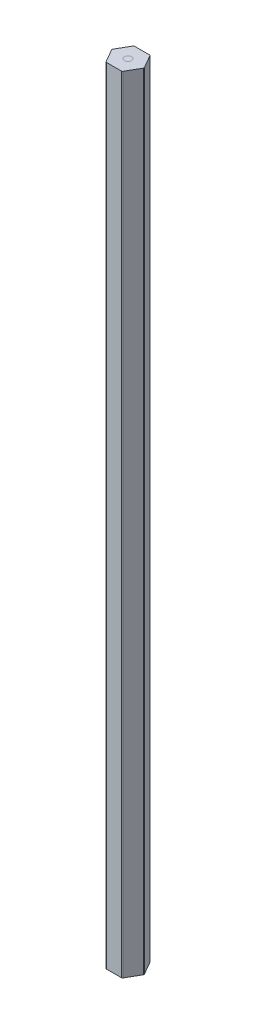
ISO-10303-21;
HEADER;
FILE_DESCRIPTION(('STEP AP214'),'2;1');
FILE_NAME('part.step','',(''),(''),'','','');
FILE_SCHEMA(('AUTOMOTIVE_DESIGN { 1 0 10303 214 1 1 1 1 }'));
ENDSEC;
DATA;
#1=APPLICATION_CONTEXT('core data for automotive mechanical design processes');
#2=APPLICATION_PROTOCOL_DEFINITION('international standard','automotive_design',2000,#1);
#3=PRODUCT_CONTEXT('',#1,'mechanical');
#4=PRODUCT('Part','Part','',(#3));
#5=PRODUCT_RELATED_PRODUCT_CATEGORY('part','',(#4));
#6=PRODUCT_DEFINITION_FORMATION('','',#4);
#7=PRODUCT_DEFINITION_CONTEXT('part definition',#1,'design');
#8=PRODUCT_DEFINITION('design','',#6,#7);
#9=PRODUCT_DEFINITION_SHAPE('','',#8);
#10=(LENGTH_UNIT() NAMED_UNIT(*) SI_UNIT(.MILLI.,.METRE.));
#11=(NAMED_UNIT(*) PLANE_ANGLE_UNIT() SI_UNIT($,.RADIAN.));
#12=(NAMED_UNIT(*) SI_UNIT($,.STERADIAN.) SOLID_ANGLE_UNIT());
#13=UNCERTAINTY_MEASURE_WITH_UNIT(LENGTH_MEASURE(1.E-05),#10,'distance_accuracy_value','');
#14=(GEOMETRIC_REPRESENTATION_CONTEXT(3) GLOBAL_UNCERTAINTY_ASSIGNED_CONTEXT((#13)) GLOBAL_UNIT_ASSIGNED_CONTEXT((#10,
#11,#12)) REPRESENTATION_CONTEXT('',''));
#15=CARTESIAN_POINT('',(0.,0.,0.));
#16=DIRECTION('',(0.,0.,1.));
#17=DIRECTION('',(1.,0.,0.));
#18=AXIS2_PLACEMENT_3D('',#15,#16,#17);
#19=CARTESIAN_POINT('',(0.,177.8,0.));
#20=DIRECTION('',(0.,-1.,0.));
#21=DIRECTION('',(0.,0.,-1.));
#22=AXIS2_PLACEMENT_3D('',#19,#20,#21);
#23=CYLINDRICAL_SURFACE('',#22,0.79375);
#24=CARTESIAN_POINT('',(0.,177.8,0.));
#25=DIRECTION('',(0.,-1.,0.));
#26=DIRECTION('',(0.,0.,-1.));
#27=AXIS2_PLACEMENT_3D('',#24,#25,#26);
#28=CIRCLE('',#27,0.79375);
#29=CARTESIAN_POINT('',(0.,177.8,-0.79375));
#30=VERTEX_POINT('',#29);
#31=EDGE_CURVE('E11',#30,#30,#28,.T.);
#32=ORIENTED_EDGE('',*,*,#31,.T.);
#33=EDGE_LOOP('',(#32));
#34=FACE_BOUND('',#33,.T.);
#35=CARTESIAN_POINT('',(0.,0.,0.));
#36=DIRECTION('',(0.,-1.,0.));
#37=DIRECTION('',(0.,0.,-1.));
#38=AXIS2_PLACEMENT_3D('',#35,#36,#37);
#39=CIRCLE('',#38,0.79375);
#40=CARTESIAN_POINT('',(0.,0.,-0.79375));
#41=VERTEX_POINT('',#40);
#42=EDGE_CURVE('E45',#41,#41,#39,.T.);
#43=ORIENTED_EDGE('',*,*,#42,.F.);
#44=EDGE_LOOP('',(#43));
#45=FACE_BOUND('',#44,.T.);
#46=ADVANCED_FACE('F42',(#34,#45),#23,.T.);
#47=CARTESIAN_POINT('',(0.,177.8,0.));
#48=DIRECTION('',(0.,-1.,0.));
#49=DIRECTION('',(0.,0.,-1.));
#50=AXIS2_PLACEMENT_3D('',#47,#48,#49);
#51=PLANE('',#50);
#52=ORIENTED_EDGE('',*,*,#31,.F.);
#53=EDGE_LOOP('',(#52));
#54=FACE_BOUND('',#53,.T.);
#55=ADVANCED_FACE('F57',(#54),#51,.F.);
#56=CARTESIAN_POINT('',(0.,0.,0.));
#57=DIRECTION('',(0.,-1.,0.));
#58=DIRECTION('',(0.,0.,-1.));
#59=AXIS2_PLACEMENT_3D('',#56,#57,#58);
#60=PLANE('',#59);
#61=ORIENTED_EDGE('',*,*,#42,.T.);
#62=EDGE_LOOP('',(#61));
#63=FACE_BOUND('',#62,.T.);
#64=ADVANCED_FACE('F54',(#63),#60,.T.);
#65=CLOSED_SHELL('',(#46,#55,#64));
#66=MANIFOLD_SOLID_BREP('B2',#65);
#67=CARTESIAN_POINT('',(-1.68644013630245,177.8,-2.92100000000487));
#68=DIRECTION('',(0.,-1.,0.));
#69=DIRECTION('',(0.,0.,-1.));
#70=AXIS2_PLACEMENT_3D('',#67,#68,#69);
#71=PLANE('',#70);
#72=CARTESIAN_POINT('',(-1.68644013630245,177.8,-2.92100000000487));
#73=DIRECTION('',(0.,1.,0.));
#74=DIRECTION('',(0.,0.,-1.));
#75=AXIS2_PLACEMENT_3D('',#72,#73,#74);
#76=CIRCLE('',#75,0.254);
#77=CARTESIAN_POINT('',(-1.68644013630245,177.8,-3.17500000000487));
#78=VERTEX_POINT('',#77);
#79=CARTESIAN_POINT('',(-1.9064105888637,177.8,-3.04800000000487));
#80=VERTEX_POINT('',#79);
#81=EDGE_CURVE('E226',#78,#80,#76,.T.);
#82=ORIENTED_EDGE('',*,*,#81,.T.);
#83=DIRECTION('',(-0.5,0.,0.866025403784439));
#84=VECTOR('',#83,1.);
#85=CARTESIAN_POINT('',(-1.9064105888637,177.8,-3.04800000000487));
#86=LINE('',#85,#84);
#87=CARTESIAN_POINT('',(-3.59285072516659,177.8,-0.127000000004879));
#88=VERTEX_POINT('',#87);
#89=EDGE_CURVE('E154',#80,#88,#86,.T.);
#90=ORIENTED_EDGE('',*,*,#89,.T.);
#91=CARTESIAN_POINT('',(-3.37288027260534,177.8,-4.87794876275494E-12));
#92=DIRECTION('',(0.,1.,0.));
#93=DIRECTION('',(0.,0.,1.));
#94=AXIS2_PLACEMENT_3D('',#91,#92,#93);
#95=CIRCLE('',#94,0.254);
#96=CARTESIAN_POINT('',(-3.59285072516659,177.8,0.126999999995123));
#97=VERTEX_POINT('',#96);
#98=EDGE_CURVE('E253',#88,#97,#95,.T.);
#99=ORIENTED_EDGE('',*,*,#98,.T.);
#100=DIRECTION('',(0.5,0.,0.866025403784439));
#101=VECTOR('',#100,1.);
#102=CARTESIAN_POINT('',(-1.90641058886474,177.8,3.04799999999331));
#103=LINE('',#102,#101);
#104=CARTESIAN_POINT('',(-1.90641058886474,177.8,3.04799999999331));
#105=VERTEX_POINT('',#104);
#106=EDGE_CURVE('E272',#97,#105,#103,.T.);
#107=ORIENTED_EDGE('',*,*,#106,.T.);
#108=CARTESIAN_POINT('',(-1.68644013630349,177.8,2.92099999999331));
#109=DIRECTION('',(0.,1.,0.));
#110=DIRECTION('',(0.,0.,1.));
#111=AXIS2_PLACEMENT_3D('',#108,#109,#110);
#112=CIRCLE('',#111,0.254);
#113=CARTESIAN_POINT('',(-1.68644013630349,177.8,3.17499999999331));
#114=VERTEX_POINT('',#113);
#115=EDGE_CURVE('E269',#105,#114,#112,.T.);
#116=ORIENTED_EDGE('',*,*,#115,.T.);
#117=DIRECTION('',(1.,0.,0.));
#118=VECTOR('',#117,1.);
#119=CARTESIAN_POINT('',(-1.68644013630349,177.8,3.17499999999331));
#120=LINE('',#119,#118);
#121=CARTESIAN_POINT('',(1.68644013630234,177.8,3.17499999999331));
#122=VERTEX_POINT('',#121);
#123=EDGE_CURVE('E271',#114,#122,#120,.T.);
#124=ORIENTED_EDGE('',*,*,#123,.T.);
#125=CARTESIAN_POINT('',(1.68644013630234,177.8,2.92099999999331));
#126=DIRECTION('',(0.,1.,0.));
#127=DIRECTION('',(0.,0.,1.));
#128=AXIS2_PLACEMENT_3D('',#125,#126,#127);
#129=CIRCLE('',#128,0.254);
#130=CARTESIAN_POINT('',(1.90641058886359,177.8,3.04799999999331));
#131=VERTEX_POINT('',#130);
#132=EDGE_CURVE('E274',#122,#131,#129,.T.);
#133=ORIENTED_EDGE('',*,*,#132,.T.);
#134=DIRECTION('',(0.5,0.,-0.866025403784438));
#135=VECTOR('',#134,1.);
#136=CARTESIAN_POINT('',(3.59285072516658,177.8,0.126999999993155));
#137=LINE('',#136,#135);
#138=CARTESIAN_POINT('',(3.59285072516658,177.8,0.126999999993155));
#139=VERTEX_POINT('',#138);
#140=EDGE_CURVE('E280',#131,#139,#137,.T.);
#141=ORIENTED_EDGE('',*,*,#140,.T.);
#142=CARTESIAN_POINT('',(3.37288027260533,177.8,-6.84646184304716E-12));
#143=DIRECTION('',(0.,1.,0.));
#144=DIRECTION('',(0.,0.,1.));
#145=AXIS2_PLACEMENT_3D('',#142,#143,#144);
#146=CIRCLE('',#145,0.254);
#147=CARTESIAN_POINT('',(3.59285072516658,177.8,-0.127000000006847));
#148=VERTEX_POINT('',#147);
#149=EDGE_CURVE('E185',#139,#148,#146,.T.);
#150=ORIENTED_EDGE('',*,*,#149,.T.);
#151=DIRECTION('',(-0.5,0.,-0.866025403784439));
#152=VECTOR('',#151,1.);
#153=CARTESIAN_POINT('',(3.59285072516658,177.8,-0.127000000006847));
#154=LINE('',#153,#152);
#155=CARTESIAN_POINT('',(1.90641058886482,177.8,-3.04800000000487));
#156=VERTEX_POINT('',#155);
#157=EDGE_CURVE('E179',#148,#156,#154,.T.);
#158=ORIENTED_EDGE('',*,*,#157,.T.);
#159=CARTESIAN_POINT('',(1.68644013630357,177.8,-2.92100000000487));
#160=DIRECTION('',(0.,1.,0.));
#161=DIRECTION('',(0.,0.,1.));
#162=AXIS2_PLACEMENT_3D('',#159,#160,#161);
#163=CIRCLE('',#162,0.254);
#164=CARTESIAN_POINT('',(1.68644013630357,177.8,-3.17500000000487));
#165=VERTEX_POINT('',#164);
#166=EDGE_CURVE('E183',#156,#165,#163,.T.);
#167=ORIENTED_EDGE('',*,*,#166,.T.);
#168=DIRECTION('',(-1.,0.,0.));
#169=VECTOR('',#168,1.);
#170=CARTESIAN_POINT('',(-1.68644013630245,177.8,-3.17500000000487));
#171=LINE('',#170,#169);
#172=EDGE_CURVE('E99',#165,#78,#171,.T.);
#173=ORIENTED_EDGE('',*,*,#172,.T.);
#174=EDGE_LOOP('',(#82,#90,#99,#107,#116,#124,#133,#141,#150,#158,#167,#173));
#175=FACE_BOUND('',#174,.T.);
#176=CARTESIAN_POINT('',(0.,177.8,0.));
#177=DIRECTION('',(0.,1.,0.));
#178=DIRECTION('',(0.,0.,1.));
#179=AXIS2_PLACEMENT_3D('',#176,#177,#178);
#180=CIRCLE('',#179,0.79375);
#181=CARTESIAN_POINT('',(0.,177.8,0.79375));
#182=VERTEX_POINT('',#181);
#183=EDGE_CURVE('E207',#182,#182,#180,.T.);
#184=ORIENTED_EDGE('',*,*,#183,.F.);
#185=EDGE_LOOP('',(#184));
#186=FACE_BOUND('',#185,.T.);
#187=ADVANCED_FACE('F82',(#175,#186),#71,.F.);
#188=CARTESIAN_POINT('',(-1.68644013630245,0.,-2.92100000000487));
#189=DIRECTION('',(0.,-1.,0.));
#190=DIRECTION('',(0.,0.,-1.));
#191=AXIS2_PLACEMENT_3D('',#188,#189,#190);
#192=PLANE('',#191);
#193=CARTESIAN_POINT('',(-1.68644013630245,0.,-2.92100000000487));
#194=DIRECTION('',(0.,1.,0.));
#195=DIRECTION('',(0.,0.,-1.));
#196=AXIS2_PLACEMENT_3D('',#193,#194,#195);
#197=CIRCLE('',#196,0.254);
#198=CARTESIAN_POINT('',(-1.68644013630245,0.,-3.17500000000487));
#199=VERTEX_POINT('',#198);
#200=CARTESIAN_POINT('',(-1.9064105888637,0.,-3.04800000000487));
#201=VERTEX_POINT('',#200);
#202=EDGE_CURVE('E203',#199,#201,#197,.T.);
#203=ORIENTED_EDGE('',*,*,#202,.F.);
#204=DIRECTION('',(-1.,0.,0.));
#205=VECTOR('',#204,1.);
#206=CARTESIAN_POINT('',(-1.68644013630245,0.,-3.17500000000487));
#207=LINE('',#206,#205);
#208=CARTESIAN_POINT('',(1.68644013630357,0.,-3.17500000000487));
#209=VERTEX_POINT('',#208);
#210=EDGE_CURVE('E146',#209,#199,#207,.T.);
#211=ORIENTED_EDGE('',*,*,#210,.F.);
#212=CARTESIAN_POINT('',(1.68644013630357,0.,-2.92100000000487));
#213=DIRECTION('',(0.,1.,0.));
#214=DIRECTION('',(0.,0.,1.));
#215=AXIS2_PLACEMENT_3D('',#212,#213,#214);
#216=CIRCLE('',#215,0.254);
#217=CARTESIAN_POINT('',(1.90641058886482,0.,-3.04800000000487));
#218=VERTEX_POINT('',#217);
#219=EDGE_CURVE('E140',#218,#209,#216,.T.);
#220=ORIENTED_EDGE('',*,*,#219,.F.);
#221=DIRECTION('',(-0.5,0.,-0.866025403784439));
#222=VECTOR('',#221,1.);
#223=CARTESIAN_POINT('',(3.59285072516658,0.,-0.127000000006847));
#224=LINE('',#223,#222);
#225=CARTESIAN_POINT('',(3.59285072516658,0.,-0.127000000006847));
#226=VERTEX_POINT('',#225);
#227=EDGE_CURVE('E193',#226,#218,#224,.T.);
#228=ORIENTED_EDGE('',*,*,#227,.F.);
#229=CARTESIAN_POINT('',(3.37288027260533,0.,-6.84646184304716E-12));
#230=DIRECTION('',(0.,1.,0.));
#231=DIRECTION('',(0.,0.,1.));
#232=AXIS2_PLACEMENT_3D('',#229,#230,#231);
#233=CIRCLE('',#232,0.254);
#234=CARTESIAN_POINT('',(3.59285072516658,0.,0.126999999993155));
#235=VERTEX_POINT('',#234);
#236=EDGE_CURVE('E221',#235,#226,#233,.T.);
#237=ORIENTED_EDGE('',*,*,#236,.F.);
#238=DIRECTION('',(0.5,0.,-0.866025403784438));
#239=VECTOR('',#238,1.);
#240=CARTESIAN_POINT('',(3.59285072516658,0.,0.126999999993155));
#241=LINE('',#240,#239);
#242=CARTESIAN_POINT('',(1.90641058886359,0.,3.04799999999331));
#243=VERTEX_POINT('',#242);
#244=EDGE_CURVE('E219',#243,#235,#241,.T.);
#245=ORIENTED_EDGE('',*,*,#244,.F.);
#246=CARTESIAN_POINT('',(1.68644013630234,0.,2.92099999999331));
#247=DIRECTION('',(0.,1.,0.));
#248=DIRECTION('',(0.,0.,1.));
#249=AXIS2_PLACEMENT_3D('',#246,#247,#248);
#250=CIRCLE('',#249,0.254);
#251=CARTESIAN_POINT('',(1.68644013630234,0.,3.17499999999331));
#252=VERTEX_POINT('',#251);
#253=EDGE_CURVE('E217',#252,#243,#250,.T.);
#254=ORIENTED_EDGE('',*,*,#253,.F.);
#255=DIRECTION('',(1.,0.,0.));
#256=VECTOR('',#255,1.);
#257=CARTESIAN_POINT('',(-1.68644013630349,0.,3.17499999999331));
#258=LINE('',#257,#256);
#259=CARTESIAN_POINT('',(-1.68644013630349,0.,3.17499999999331));
#260=VERTEX_POINT('',#259);
#261=EDGE_CURVE('E215',#260,#252,#258,.T.);
#262=ORIENTED_EDGE('',*,*,#261,.F.);
#263=CARTESIAN_POINT('',(-1.68644013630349,0.,2.92099999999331));
#264=DIRECTION('',(0.,1.,0.));
#265=DIRECTION('',(0.,0.,1.));
#266=AXIS2_PLACEMENT_3D('',#263,#264,#265);
#267=CIRCLE('',#266,0.254);
#268=CARTESIAN_POINT('',(-1.90641058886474,0.,3.04799999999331));
#269=VERTEX_POINT('',#268);
#270=EDGE_CURVE('E213',#269,#260,#267,.T.);
#271=ORIENTED_EDGE('',*,*,#270,.F.);
#272=DIRECTION('',(0.5,0.,0.866025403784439));
#273=VECTOR('',#272,1.);
#274=CARTESIAN_POINT('',(-1.90641058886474,0.,3.04799999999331));
#275=LINE('',#274,#273);
#276=CARTESIAN_POINT('',(-3.59285072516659,0.,0.126999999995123));
#277=VERTEX_POINT('',#276);
#278=EDGE_CURVE('E211',#277,#269,#275,.T.);
#279=ORIENTED_EDGE('',*,*,#278,.F.);
#280=CARTESIAN_POINT('',(-3.37288027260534,0.,-4.87794876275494E-12));
#281=DIRECTION('',(0.,1.,0.));
#282=DIRECTION('',(0.,0.,1.));
#283=AXIS2_PLACEMENT_3D('',#280,#281,#282);
#284=CIRCLE('',#283,0.254);
#285=CARTESIAN_POINT('',(-3.59285072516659,0.,-0.127000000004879));
#286=VERTEX_POINT('',#285);
#287=EDGE_CURVE('E209',#286,#277,#284,.T.);
#288=ORIENTED_EDGE('',*,*,#287,.F.);
#289=DIRECTION('',(-0.5,0.,0.866025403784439));
#290=VECTOR('',#289,1.);
#291=CARTESIAN_POINT('',(-1.9064105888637,0.,-3.04800000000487));
#292=LINE('',#291,#290);
#293=EDGE_CURVE('E206',#201,#286,#292,.T.);
#294=ORIENTED_EDGE('',*,*,#293,.F.);
#295=EDGE_LOOP('',(#203,#211,#220,#228,#237,#245,#254,#262,#271,#279,#288,#294));
#296=FACE_BOUND('',#295,.T.);
#297=CARTESIAN_POINT('',(0.,0.,0.));
#298=DIRECTION('',(0.,1.,0.));
#299=DIRECTION('',(0.,0.,1.));
#300=AXIS2_PLACEMENT_3D('',#297,#298,#299);
#301=CIRCLE('',#300,0.79375);
#302=CARTESIAN_POINT('',(0.,0.,0.79375));
#303=VERTEX_POINT('',#302);
#304=EDGE_CURVE('E462',#303,#303,#301,.T.);
#305=ORIENTED_EDGE('',*,*,#304,.T.);
#306=EDGE_LOOP('',(#305));
#307=FACE_BOUND('',#306,.T.);
#308=ADVANCED_FACE('F257',(#296,#307),#192,.T.);
#309=CARTESIAN_POINT('',(-1.68644013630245,177.8,-2.92100000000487));
#310=DIRECTION('',(0.,-1.,0.));
#311=DIRECTION('',(0.,0.,-1.));
#312=AXIS2_PLACEMENT_3D('',#309,#310,#311);
#313=CYLINDRICAL_SURFACE('',#312,0.254);
#314=ORIENTED_EDGE('',*,*,#202,.T.);
#315=DIRECTION('',(0.,-1.,0.));
#316=VECTOR('',#315,1.);
#317=CARTESIAN_POINT('',(-1.9064105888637,177.8,-3.04800000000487));
#318=LINE('',#317,#316);
#319=EDGE_CURVE('E40',#80,#201,#318,.T.);
#320=ORIENTED_EDGE('',*,*,#319,.F.);
#321=ORIENTED_EDGE('',*,*,#81,.F.);
#322=DIRECTION('',(0.,-1.,0.));
#323=VECTOR('',#322,1.);
#324=CARTESIAN_POINT('',(-1.68644013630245,177.8,-3.17500000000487));
#325=LINE('',#324,#323);
#326=EDGE_CURVE('E199',#78,#199,#325,.T.);
#327=ORIENTED_EDGE('',*,*,#326,.T.);
#328=EDGE_LOOP('',(#314,#320,#321,#327));
#329=FACE_BOUND('',#328,.T.);
#330=ADVANCED_FACE('F84',(#329),#313,.T.);
#331=CARTESIAN_POINT('',(-1.9064105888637,177.8,-3.04800000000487));
#332=DIRECTION('',(0.866025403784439,0.,0.5));
#333=DIRECTION('',(0.5,0.,-0.866025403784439));
#334=AXIS2_PLACEMENT_3D('',#331,#332,#333);
#335=PLANE('',#334);
#336=ORIENTED_EDGE('',*,*,#293,.T.);
#337=DIRECTION('',(0.,-1.,0.));
#338=VECTOR('',#337,1.);
#339=CARTESIAN_POINT('',(-3.59285072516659,177.8,-0.127000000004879));
#340=LINE('',#339,#338);
#341=EDGE_CURVE('E91',#88,#286,#340,.T.);
#342=ORIENTED_EDGE('',*,*,#341,.F.);
#343=ORIENTED_EDGE('',*,*,#89,.F.);
#344=ORIENTED_EDGE('',*,*,#319,.T.);
#345=EDGE_LOOP('',(#336,#342,#343,#344));
#346=FACE_BOUND('',#345,.T.);
#347=ADVANCED_FACE('F314',(#346),#335,.F.);
#348=CARTESIAN_POINT('',(-3.37288027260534,177.8,-4.87794876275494E-12));
#349=DIRECTION('',(0.,-1.,0.));
#350=DIRECTION('',(0.,0.,-1.));
#351=AXIS2_PLACEMENT_3D('',#348,#349,#350);
#352=CYLINDRICAL_SURFACE('',#351,0.254);
#353=ORIENTED_EDGE('',*,*,#287,.T.);
#354=DIRECTION('',(0.,-1.,0.));
#355=VECTOR('',#354,1.);
#356=CARTESIAN_POINT('',(-3.59285072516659,177.8,0.126999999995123));
#357=LINE('',#356,#355);
#358=EDGE_CURVE('E245',#97,#277,#357,.T.);
#359=ORIENTED_EDGE('',*,*,#358,.F.);
#360=ORIENTED_EDGE('',*,*,#98,.F.);
#361=ORIENTED_EDGE('',*,*,#341,.T.);
#362=EDGE_LOOP('',(#353,#359,#360,#361));
#363=FACE_BOUND('',#362,.T.);
#364=ADVANCED_FACE('F251',(#363),#352,.T.);
#365=CARTESIAN_POINT('',(-1.90641058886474,177.8,3.04799999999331));
#366=DIRECTION('',(0.866025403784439,0.,-0.5));
#367=DIRECTION('',(-0.5,0.,-0.866025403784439));
#368=AXIS2_PLACEMENT_3D('',#365,#366,#367);
#369=PLANE('',#368);
#370=ORIENTED_EDGE('',*,*,#278,.T.);
#371=DIRECTION('',(0.,-1.,0.));
#372=VECTOR('',#371,1.);
#373=CARTESIAN_POINT('',(-1.90641058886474,177.8,3.04799999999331));
#374=LINE('',#373,#372);
#375=EDGE_CURVE('E242',#105,#269,#374,.T.);
#376=ORIENTED_EDGE('',*,*,#375,.F.);
#377=ORIENTED_EDGE('',*,*,#106,.F.);
#378=ORIENTED_EDGE('',*,*,#358,.T.);
#379=EDGE_LOOP('',(#370,#376,#377,#378));
#380=FACE_BOUND('',#379,.T.);
#381=ADVANCED_FACE('F263',(#380),#369,.F.);
#382=CARTESIAN_POINT('',(-1.68644013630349,177.8,2.92099999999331));
#383=DIRECTION('',(0.,-1.,0.));
#384=DIRECTION('',(0.,0.,-1.));
#385=AXIS2_PLACEMENT_3D('',#382,#383,#384);
#386=CYLINDRICAL_SURFACE('',#385,0.254);
#387=ORIENTED_EDGE('',*,*,#270,.T.);
#388=DIRECTION('',(0.,-1.,0.));
#389=VECTOR('',#388,1.);
#390=CARTESIAN_POINT('',(-1.68644013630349,177.8,3.17499999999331));
#391=LINE('',#390,#389);
#392=EDGE_CURVE('E239',#114,#260,#391,.T.);
#393=ORIENTED_EDGE('',*,*,#392,.F.);
#394=ORIENTED_EDGE('',*,*,#115,.F.);
#395=ORIENTED_EDGE('',*,*,#375,.T.);
#396=EDGE_LOOP('',(#387,#393,#394,#395));
#397=FACE_BOUND('',#396,.T.);
#398=ADVANCED_FACE('F267',(#397),#386,.T.);
#399=CARTESIAN_POINT('',(-1.68644013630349,177.8,3.17499999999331));
#400=DIRECTION('',(0.,0.,-1.));
#401=DIRECTION('',(-1.,0.,0.));
#402=AXIS2_PLACEMENT_3D('',#399,#400,#401);
#403=PLANE('',#402);
#404=ORIENTED_EDGE('',*,*,#261,.T.);
#405=DIRECTION('',(0.,-1.,0.));
#406=VECTOR('',#405,1.);
#407=CARTESIAN_POINT('',(1.68644013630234,177.8,3.17499999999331));
#408=LINE('',#407,#406);
#409=EDGE_CURVE('E236',#122,#252,#408,.T.);
#410=ORIENTED_EDGE('',*,*,#409,.F.);
#411=ORIENTED_EDGE('',*,*,#123,.F.);
#412=ORIENTED_EDGE('',*,*,#392,.T.);
#413=EDGE_LOOP('',(#404,#410,#411,#412));
#414=FACE_BOUND('',#413,.T.);
#415=ADVANCED_FACE('F327',(#414),#403,.F.);
#416=CARTESIAN_POINT('',(1.68644013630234,177.8,2.92099999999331));
#417=DIRECTION('',(0.,-1.,0.));
#418=DIRECTION('',(0.,0.,-1.));
#419=AXIS2_PLACEMENT_3D('',#416,#417,#418);
#420=CYLINDRICAL_SURFACE('',#419,0.254);
#421=ORIENTED_EDGE('',*,*,#253,.T.);
#422=DIRECTION('',(0.,-1.,0.));
#423=VECTOR('',#422,1.);
#424=CARTESIAN_POINT('',(1.90641058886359,177.8,3.04799999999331));
#425=LINE('',#424,#423);
#426=EDGE_CURVE('E233',#131,#243,#425,.T.);
#427=ORIENTED_EDGE('',*,*,#426,.F.);
#428=ORIENTED_EDGE('',*,*,#132,.F.);
#429=ORIENTED_EDGE('',*,*,#409,.T.);
#430=EDGE_LOOP('',(#421,#427,#428,#429));
#431=FACE_BOUND('',#430,.T.);
#432=ADVANCED_FACE('F330',(#431),#420,.T.);
#433=CARTESIAN_POINT('',(3.59285072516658,177.8,0.126999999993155));
#434=DIRECTION('',(-0.866025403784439,0.,-0.5));
#435=DIRECTION('',(-0.5,0.,0.866025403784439));
#436=AXIS2_PLACEMENT_3D('',#433,#434,#435);
#437=PLANE('',#436);
#438=ORIENTED_EDGE('',*,*,#244,.T.);
#439=DIRECTION('',(0.,-1.,0.));
#440=VECTOR('',#439,1.);
#441=CARTESIAN_POINT('',(3.59285072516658,177.8,0.126999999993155));
#442=LINE('',#441,#440);
#443=EDGE_CURVE('E230',#139,#235,#442,.T.);
#444=ORIENTED_EDGE('',*,*,#443,.F.);
#445=ORIENTED_EDGE('',*,*,#140,.F.);
#446=ORIENTED_EDGE('',*,*,#426,.T.);
#447=EDGE_LOOP('',(#438,#444,#445,#446));
#448=FACE_BOUND('',#447,.T.);
#449=ADVANCED_FACE('F286',(#448),#437,.F.);
#450=CARTESIAN_POINT('',(3.37288027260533,177.8,-6.84646184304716E-12));
#451=DIRECTION('',(0.,-1.,0.));
#452=DIRECTION('',(0.,0.,-1.));
#453=AXIS2_PLACEMENT_3D('',#450,#451,#452);
#454=CYLINDRICAL_SURFACE('',#453,0.254);
#455=ORIENTED_EDGE('',*,*,#236,.T.);
#456=DIRECTION('',(0.,-1.,0.));
#457=VECTOR('',#456,1.);
#458=CARTESIAN_POINT('',(3.59285072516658,177.8,-0.127000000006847));
#459=LINE('',#458,#457);
#460=EDGE_CURVE('E194',#148,#226,#459,.T.);
#461=ORIENTED_EDGE('',*,*,#460,.F.);
#462=ORIENTED_EDGE('',*,*,#149,.F.);
#463=ORIENTED_EDGE('',*,*,#443,.T.);
#464=EDGE_LOOP('',(#455,#461,#462,#463));
#465=FACE_BOUND('',#464,.T.);
#466=ADVANCED_FACE('F290',(#465),#454,.T.);
#467=CARTESIAN_POINT('',(3.59285072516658,177.8,-0.127000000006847));
#468=DIRECTION('',(-0.866025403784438,0.,0.5));
#469=DIRECTION('',(0.5,0.,0.866025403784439));
#470=AXIS2_PLACEMENT_3D('',#467,#468,#469);
#471=PLANE('',#470);
#472=ORIENTED_EDGE('',*,*,#227,.T.);
#473=DIRECTION('',(0.,-1.,0.));
#474=VECTOR('',#473,1.);
#475=CARTESIAN_POINT('',(1.90641058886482,177.8,-3.04800000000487));
#476=LINE('',#475,#474);
#477=EDGE_CURVE('E190',#156,#218,#476,.T.);
#478=ORIENTED_EDGE('',*,*,#477,.F.);
#479=ORIENTED_EDGE('',*,*,#157,.F.);
#480=ORIENTED_EDGE('',*,*,#460,.T.);
#481=EDGE_LOOP('',(#472,#478,#479,#480));
#482=FACE_BOUND('',#481,.T.);
#483=ADVANCED_FACE('F191',(#482),#471,.F.);
#484=CARTESIAN_POINT('',(1.68644013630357,177.8,-2.92100000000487));
#485=DIRECTION('',(0.,-1.,0.));
#486=DIRECTION('',(0.,0.,-1.));
#487=AXIS2_PLACEMENT_3D('',#484,#485,#486);
#488=CYLINDRICAL_SURFACE('',#487,0.254);
#489=ORIENTED_EDGE('',*,*,#219,.T.);
#490=DIRECTION('',(0.,-1.,0.));
#491=VECTOR('',#490,1.);
#492=CARTESIAN_POINT('',(1.68644013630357,177.8,-3.17500000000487));
#493=LINE('',#492,#491);
#494=EDGE_CURVE('E195',#165,#209,#493,.T.);
#495=ORIENTED_EDGE('',*,*,#494,.F.);
#496=ORIENTED_EDGE('',*,*,#166,.F.);
#497=ORIENTED_EDGE('',*,*,#477,.T.);
#498=EDGE_LOOP('',(#489,#495,#496,#497));
#499=FACE_BOUND('',#498,.T.);
#500=ADVANCED_FACE('F197',(#499),#488,.T.);
#501=CARTESIAN_POINT('',(-1.68644013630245,177.8,-3.17500000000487));
#502=DIRECTION('',(0.,0.,1.));
#503=DIRECTION('',(1.,0.,0.));
#504=AXIS2_PLACEMENT_3D('',#501,#502,#503);
#505=PLANE('',#504);
#506=ORIENTED_EDGE('',*,*,#210,.T.);
#507=ORIENTED_EDGE('',*,*,#326,.F.);
#508=ORIENTED_EDGE('',*,*,#172,.F.);
#509=ORIENTED_EDGE('',*,*,#494,.T.);
#510=EDGE_LOOP('',(#506,#507,#508,#509));
#511=FACE_BOUND('',#510,.T.);
#512=ADVANCED_FACE('F294',(#511),#505,.F.);
#513=CARTESIAN_POINT('',(0.,177.8,0.));
#514=DIRECTION('',(0.,-1.,0.));
#515=DIRECTION('',(0.,0.,-1.));
#516=AXIS2_PLACEMENT_3D('',#513,#514,#515);
#517=CYLINDRICAL_SURFACE('',#516,0.79375);
#518=ORIENTED_EDGE('',*,*,#183,.T.);
#519=EDGE_LOOP('',(#518));
#520=FACE_BOUND('',#519,.T.);
#521=ORIENTED_EDGE('',*,*,#304,.F.);
#522=EDGE_LOOP('',(#521));
#523=FACE_BOUND('',#522,.T.);
#524=ADVANCED_FACE('F296',(#520,#523),#517,.F.);
#525=CLOSED_SHELL('',(#187,#308,#330,#347,#364,#381,#398,#415,#432,#449,#466,#483,#500,#512,#524));
#526=MANIFOLD_SOLID_BREP('B6',#525);
#527=ADVANCED_BREP_SHAPE_REPRESENTATION('',(#18,#66,#526),#14);
#528=SHAPE_DEFINITION_REPRESENTATION(#9,#527);
ENDSEC;
END-ISO-10303-21;
